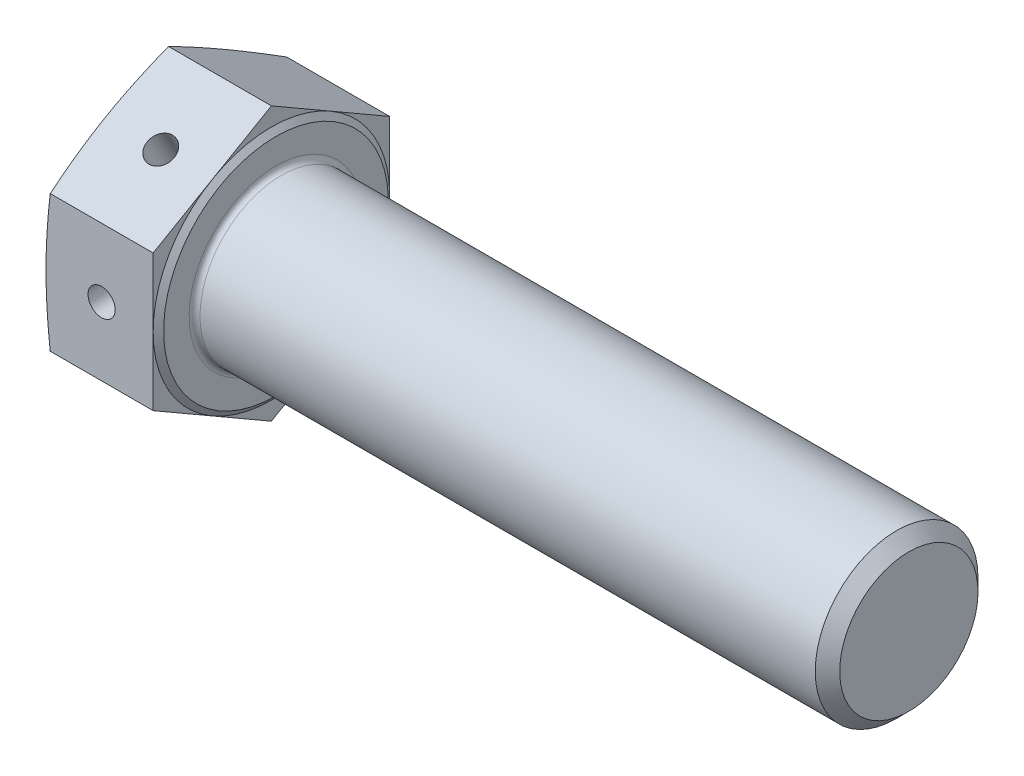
ISO-10303-21;
HEADER;
FILE_DESCRIPTION(('STEP AP214'),'2;1');
FILE_NAME('part.step','',(''),(''),'','','');
FILE_SCHEMA(('AUTOMOTIVE_DESIGN { 1 0 10303 214 1 1 1 1 }'));
ENDSEC;
DATA;
#1=APPLICATION_CONTEXT('core data for automotive mechanical design processes');
#2=APPLICATION_PROTOCOL_DEFINITION('international standard','automotive_design',2000,#1);
#3=PRODUCT_CONTEXT('',#1,'mechanical');
#4=PRODUCT('Part','Part','',(#3));
#5=PRODUCT_RELATED_PRODUCT_CATEGORY('part','',(#4));
#6=PRODUCT_DEFINITION_FORMATION('','',#4);
#7=PRODUCT_DEFINITION_CONTEXT('part definition',#1,'design');
#8=PRODUCT_DEFINITION('design','',#6,#7);
#9=PRODUCT_DEFINITION_SHAPE('','',#8);
#10=(LENGTH_UNIT() NAMED_UNIT(*) SI_UNIT(.MILLI.,.METRE.));
#11=(NAMED_UNIT(*) PLANE_ANGLE_UNIT() SI_UNIT($,.RADIAN.));
#12=(NAMED_UNIT(*) SI_UNIT($,.STERADIAN.) SOLID_ANGLE_UNIT());
#13=UNCERTAINTY_MEASURE_WITH_UNIT(LENGTH_MEASURE(1.E-05),#10,'distance_accuracy_value','');
#14=(GEOMETRIC_REPRESENTATION_CONTEXT(3) GLOBAL_UNCERTAINTY_ASSIGNED_CONTEXT((#13)) GLOBAL_UNIT_ASSIGNED_CONTEXT((#10,
#11,#12)) REPRESENTATION_CONTEXT('',''));
#15=CARTESIAN_POINT('',(0.,0.,0.));
#16=DIRECTION('',(0.,0.,1.));
#17=DIRECTION('',(1.,0.,0.));
#18=AXIS2_PLACEMENT_3D('',#15,#16,#17);
#19=CARTESIAN_POINT('',(6.15,0.,-13.08));
#20=DIRECTION('',(0.,0.,1.));
#21=DIRECTION('',(1.,0.,0.));
#22=AXIS2_PLACEMENT_3D('',#19,#20,#21);
#23=CYLINDRICAL_SURFACE('',#22,1.5);
#24=CARTESIAN_POINT('',(6.15,0.,13.08));
#25=DIRECTION('',(0.,0.,1.));
#26=DIRECTION('',(1.,0.,0.));
#27=AXIS2_PLACEMENT_3D('',#24,#25,#26);
#28=CIRCLE('',#27,1.5);
#29=CARTESIAN_POINT('',(7.65,0.,13.08));
#30=VERTEX_POINT('',#29);
#31=EDGE_CURVE('E584',#30,#30,#28,.T.);
#32=ORIENTED_EDGE('',*,*,#31,.T.);
#33=EDGE_LOOP('',(#32));
#34=FACE_BOUND('',#33,.T.);
#35=CARTESIAN_POINT('',(6.15,0.,0.));
#36=DIRECTION('',(0.,-0.866025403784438,0.500000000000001));
#37=DIRECTION('',(0.,0.500000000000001,0.866025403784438));
#38=AXIS2_PLACEMENT_3D('',#35,#36,#37);
#39=ELLIPSE('',#38,2.99999999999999,1.5);
#40=CARTESIAN_POINT('',(4.65,0.,0.));
#41=VERTEX_POINT('',#40);
#42=CARTESIAN_POINT('',(7.65,0.,0.));
#43=VERTEX_POINT('',#42);
#44=EDGE_CURVE('E46',#41,#43,#39,.F.);
#45=ORIENTED_EDGE('',*,*,#44,.T.);
#46=CARTESIAN_POINT('',(6.15,0.,0.));
#47=DIRECTION('',(0.,0.500000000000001,0.866025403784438));
#48=DIRECTION('',(0.,-0.866025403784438,0.500000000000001));
#49=AXIS2_PLACEMENT_3D('',#46,#47,#48);
#50=ELLIPSE('',#49,1.73205080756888,1.5);
#51=EDGE_CURVE('E11',#43,#41,#50,.F.);
#52=ORIENTED_EDGE('',*,*,#51,.T.);
#53=EDGE_LOOP('',(#45,#52));
#54=FACE_BOUND('',#53,.T.);
#55=ADVANCED_FACE('F32',(#34,#54),#23,.F.);
#56=CARTESIAN_POINT('',(12.35,0.,0.));
#57=DIRECTION('',(-1.,0.,0.));
#58=DIRECTION('',(0.,-1.,0.));
#59=AXIS2_PLACEMENT_3D('',#56,#57,#58);
#60=PLANE('',#59);
#61=CARTESIAN_POINT('',(12.35,0.,0.));
#62=DIRECTION('',(-1.,0.,0.));
#63=DIRECTION('',(0.,-1.,0.));
#64=AXIS2_PLACEMENT_3D('',#61,#62,#63);
#65=CIRCLE('',#64,9.6);
#66=CARTESIAN_POINT('',(12.35,-9.6,0.));
#67=VERTEX_POINT('',#66);
#68=EDGE_CURVE('E137',#67,#67,#65,.T.);
#69=ORIENTED_EDGE('',*,*,#68,.T.);
#70=EDGE_LOOP('',(#69));
#71=FACE_BOUND('',#70,.T.);
#72=CARTESIAN_POINT('',(12.35,0.,0.));
#73=DIRECTION('',(-1.,0.,0.));
#74=DIRECTION('',(0.,-1.,0.));
#75=AXIS2_PLACEMENT_3D('',#72,#73,#74);
#76=CIRCLE('',#75,12.425);
#77=CARTESIAN_POINT('',(12.35,-12.425,0.));
#78=VERTEX_POINT('',#77);
#79=EDGE_CURVE('E284',#78,#78,#76,.T.);
#80=ORIENTED_EDGE('',*,*,#79,.F.);
#81=EDGE_LOOP('',(#80));
#82=FACE_BOUND('',#81,.T.);
#83=ADVANCED_FACE('F239',(#71,#82),#60,.F.);
#84=CARTESIAN_POINT('',(11.85,-22.6552245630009,-13.08));
#85=DIRECTION('',(1.,0.,0.));
#86=DIRECTION('',(0.,0.,-1.));
#87=AXIS2_PLACEMENT_3D('',#84,#85,#86);
#88=PLANE('',#87);
#89=DIRECTION('',(0.,-0.5,-0.866025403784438));
#90=VECTOR('',#89,1.);
#91=CARTESIAN_POINT('',(11.85,-7.55174152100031,13.08));
#92=LINE('',#91,#90);
#93=CARTESIAN_POINT('',(11.85,-7.55174152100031,13.08));
#94=VERTEX_POINT('',#93);
#95=CARTESIAN_POINT('',(11.85,-11.3276122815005,6.54));
#96=VERTEX_POINT('',#95);
#97=EDGE_CURVE('E197',#94,#96,#92,.T.);
#98=ORIENTED_EDGE('',*,*,#97,.T.);
#99=CARTESIAN_POINT('',(11.85,0.,0.));
#100=DIRECTION('',(-1.,0.,0.));
#101=DIRECTION('',(0.,-1.,0.));
#102=AXIS2_PLACEMENT_3D('',#99,#100,#101);
#103=CIRCLE('',#102,13.08);
#104=CARTESIAN_POINT('',(11.85,0.,13.08));
#105=VERTEX_POINT('',#104);
#106=EDGE_CURVE('E54',#96,#105,#103,.T.);
#107=ORIENTED_EDGE('',*,*,#106,.T.);
#108=DIRECTION('',(0.,-1.,0.));
#109=VECTOR('',#108,1.);
#110=CARTESIAN_POINT('',(11.85,7.55174152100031,13.08));
#111=LINE('',#110,#109);
#112=EDGE_CURVE('E180',#105,#94,#111,.T.);
#113=ORIENTED_EDGE('',*,*,#112,.T.);
#114=EDGE_LOOP('',(#98,#107,#113));
#115=FACE_BOUND('',#114,.T.);
#116=ADVANCED_FACE('F245',(#115),#88,.T.);
#117=CARTESIAN_POINT('',(11.85,7.55174152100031,13.08));
#118=VERTEX_POINT('',#117);
#119=EDGE_CURVE('E177',#118,#105,#111,.T.);
#120=ORIENTED_EDGE('',*,*,#119,.T.);
#121=CARTESIAN_POINT('',(11.85,11.3276122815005,6.54));
#122=VERTEX_POINT('',#121);
#123=EDGE_CURVE('E153',#105,#122,#103,.T.);
#124=ORIENTED_EDGE('',*,*,#123,.T.);
#125=DIRECTION('',(0.,-0.5,0.866025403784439));
#126=VECTOR('',#125,1.);
#127=CARTESIAN_POINT('',(11.85,15.1034830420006,0.));
#128=LINE('',#127,#126);
#129=EDGE_CURVE('E184',#122,#118,#128,.T.);
#130=ORIENTED_EDGE('',*,*,#129,.T.);
#131=EDGE_LOOP('',(#120,#124,#130));
#132=FACE_BOUND('',#131,.T.);
#133=ADVANCED_FACE('F341',(#132),#88,.T.);
#134=CARTESIAN_POINT('',(11.85,15.1034830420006,0.));
#135=VERTEX_POINT('',#134);
#136=EDGE_CURVE('E181',#135,#122,#128,.T.);
#137=ORIENTED_EDGE('',*,*,#136,.T.);
#138=CARTESIAN_POINT('',(11.85,11.3276122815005,-6.54));
#139=VERTEX_POINT('',#138);
#140=EDGE_CURVE('E346',#122,#139,#103,.T.);
#141=ORIENTED_EDGE('',*,*,#140,.T.);
#142=DIRECTION('',(0.,0.5,0.866025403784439));
#143=VECTOR('',#142,1.);
#144=CARTESIAN_POINT('',(11.85,7.55174152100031,-13.08));
#145=LINE('',#144,#143);
#146=EDGE_CURVE('E188',#139,#135,#145,.T.);
#147=ORIENTED_EDGE('',*,*,#146,.T.);
#148=EDGE_LOOP('',(#137,#141,#147));
#149=FACE_BOUND('',#148,.T.);
#150=ADVANCED_FACE('F345',(#149),#88,.T.);
#151=CARTESIAN_POINT('',(11.85,7.55174152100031,-13.08));
#152=VERTEX_POINT('',#151);
#153=EDGE_CURVE('E185',#152,#139,#145,.T.);
#154=ORIENTED_EDGE('',*,*,#153,.T.);
#155=CARTESIAN_POINT('',(11.85,0.,-13.08));
#156=VERTEX_POINT('',#155);
#157=EDGE_CURVE('E405',#139,#156,#103,.T.);
#158=ORIENTED_EDGE('',*,*,#157,.T.);
#159=DIRECTION('',(0.,1.,0.));
#160=VECTOR('',#159,1.);
#161=CARTESIAN_POINT('',(11.85,-7.55174152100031,-13.08));
#162=LINE('',#161,#160);
#163=EDGE_CURVE('E192',#156,#152,#162,.T.);
#164=ORIENTED_EDGE('',*,*,#163,.T.);
#165=EDGE_LOOP('',(#154,#158,#164));
#166=FACE_BOUND('',#165,.T.);
#167=ADVANCED_FACE('F398',(#166),#88,.T.);
#168=CARTESIAN_POINT('',(11.85,-7.55174152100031,-13.08));
#169=VERTEX_POINT('',#168);
#170=EDGE_CURVE('E189',#169,#156,#162,.T.);
#171=ORIENTED_EDGE('',*,*,#170,.T.);
#172=CARTESIAN_POINT('',(11.85,-11.3276122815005,-6.53999999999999));
#173=VERTEX_POINT('',#172);
#174=EDGE_CURVE('E403',#156,#173,#103,.T.);
#175=ORIENTED_EDGE('',*,*,#174,.T.);
#176=DIRECTION('',(0.,0.5,-0.866025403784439));
#177=VECTOR('',#176,1.);
#178=CARTESIAN_POINT('',(11.85,-15.1034830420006,0.));
#179=LINE('',#178,#177);
#180=EDGE_CURVE('E196',#173,#169,#179,.T.);
#181=ORIENTED_EDGE('',*,*,#180,.T.);
#182=EDGE_LOOP('',(#171,#175,#181));
#183=FACE_BOUND('',#182,.T.);
#184=ADVANCED_FACE('F393',(#183),#88,.T.);
#185=CARTESIAN_POINT('',(11.85,-15.1034830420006,0.));
#186=VERTEX_POINT('',#185);
#187=EDGE_CURVE('E193',#186,#173,#179,.T.);
#188=ORIENTED_EDGE('',*,*,#187,.T.);
#189=EDGE_CURVE('E292',#173,#96,#103,.T.);
#190=ORIENTED_EDGE('',*,*,#189,.T.);
#191=EDGE_CURVE('E200',#96,#186,#92,.T.);
#192=ORIENTED_EDGE('',*,*,#191,.T.);
#193=EDGE_LOOP('',(#188,#190,#192));
#194=FACE_BOUND('',#193,.T.);
#195=ADVANCED_FACE('F234',(#194),#88,.T.);
#196=CARTESIAN_POINT('',(11.85,-7.55174152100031,13.08));
#197=DIRECTION('',(0.,0.866025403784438,-0.5));
#198=DIRECTION('',(0.,0.5,0.866025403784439));
#199=AXIS2_PLACEMENT_3D('',#196,#197,#198);
#200=PLANE('',#199);
#201=CARTESIAN_POINT('',(0.470161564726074,-15.1035985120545,-0.000199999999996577));
#202=CARTESIAN_POINT('',(0.397206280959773,-14.7897253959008,0.543444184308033));
#203=CARTESIAN_POINT('',(0.331014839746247,-14.4754225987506,1.08783259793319));
#204=CARTESIAN_POINT('',(0.214770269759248,-13.8459819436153,2.178055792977));
#205=CARTESIAN_POINT('',(0.164722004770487,-13.5308438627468,2.72389096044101));
#206=CARTESIAN_POINT('',(0.0835795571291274,-12.9011725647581,3.81451364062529));
#207=CARTESIAN_POINT('',(0.0524124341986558,-12.5866417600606,4.35929697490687));
#208=CARTESIAN_POINT('',(0.0106241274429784,-11.9572780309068,5.44938693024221));
#209=CARTESIAN_POINT('',(0.,-11.6424451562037,5.99469346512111));
#210=CARTESIAN_POINT('',(0.,-11.0127794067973,7.0853065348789));
#211=CARTESIAN_POINT('',(0.0106241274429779,-10.6979465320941,7.63061306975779));
#212=CARTESIAN_POINT('',(0.0524124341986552,-10.0685828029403,8.72070302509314));
#213=CARTESIAN_POINT('',(0.0835795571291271,-9.75405199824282,9.26548635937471));
#214=CARTESIAN_POINT('',(0.164722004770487,-9.12438070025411,10.356109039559));
#215=CARTESIAN_POINT('',(0.214770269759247,-8.8092426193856,10.901944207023));
#216=CARTESIAN_POINT('',(0.331014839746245,-8.17980196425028,11.9921674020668));
#217=CARTESIAN_POINT('',(0.397206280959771,-7.86549916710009,12.536555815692));
#218=CARTESIAN_POINT('',(0.470161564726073,-7.55162605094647,13.0802));
#219=B_SPLINE_CURVE_WITH_KNOTS('',3,(#201,#202,#203,#204,#205,#206,#207,#208,#209,#210,#211,
#212,#213,#214,#215,#216,#217,#218),.UNSPECIFIED.,.F.,.F.,(4,2,2,2,2,2,2,2,4),(0.,
1.89598725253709,3.79254521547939,5.68172901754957,7.57064209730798,9.45955517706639,
11.3487389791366,13.2452969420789,15.141284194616),.UNSPECIFIED.);
#220=CARTESIAN_POINT('',(0.470134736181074,-15.1034830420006,0.));
#221=VERTEX_POINT('',#220);
#222=CARTESIAN_POINT('',(0.,-11.3276122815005,6.53999999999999));
#223=VERTEX_POINT('',#222);
#224=EDGE_CURVE('E356',#221,#223,#219,.T.);
#225=ORIENTED_EDGE('',*,*,#224,.F.);
#226=DIRECTION('',(-1.,0.,0.));
#227=VECTOR('',#226,1.);
#228=CARTESIAN_POINT('',(11.85,-15.1034830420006,0.));
#229=LINE('',#228,#227);
#230=EDGE_CURVE('E158',#186,#221,#229,.T.);
#231=ORIENTED_EDGE('',*,*,#230,.F.);
#232=ORIENTED_EDGE('',*,*,#191,.F.);
#233=ORIENTED_EDGE('',*,*,#97,.F.);
#234=DIRECTION('',(-1.,0.,0.));
#235=VECTOR('',#234,1.);
#236=CARTESIAN_POINT('',(11.85,-7.55174152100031,13.08));
#237=LINE('',#236,#235);
#238=CARTESIAN_POINT('',(0.470134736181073,-7.5517415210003,13.08));
#239=VERTEX_POINT('',#238);
#240=EDGE_CURVE('E174',#94,#239,#237,.T.);
#241=ORIENTED_EDGE('',*,*,#240,.T.);
#242=EDGE_CURVE('E333',#223,#239,#219,.T.);
#243=ORIENTED_EDGE('',*,*,#242,.F.);
#244=EDGE_LOOP('',(#225,#231,#232,#233,#241,#243));
#245=FACE_BOUND('',#244,.T.);
#246=ADVANCED_FACE('F34',(#245),#200,.F.);
#247=CARTESIAN_POINT('',(11.85,-15.1034830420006,0.));
#248=DIRECTION('',(0.,0.866025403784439,0.5));
#249=DIRECTION('',(0.,-0.5,0.866025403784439));
#250=AXIS2_PLACEMENT_3D('',#247,#248,#249);
#251=PLANE('',#250);
#252=CARTESIAN_POINT('',(6.15,-11.3276122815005,-6.53999999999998));
#253=DIRECTION('',(0.,0.866025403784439,0.5));
#254=DIRECTION('',(0.,-0.5,0.866025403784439));
#255=AXIS2_PLACEMENT_3D('',#252,#253,#254);
#256=CIRCLE('',#255,1.5);
#257=CARTESIAN_POINT('',(6.15,-12.0776122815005,-5.24096189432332));
#258=VERTEX_POINT('',#257);
#259=EDGE_CURVE('E582',#258,#258,#256,.T.);
#260=ORIENTED_EDGE('',*,*,#259,.T.);
#261=EDGE_LOOP('',(#260));
#262=FACE_BOUND('',#261,.T.);
#263=CARTESIAN_POINT('',(0.470161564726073,-7.55162605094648,-13.0802));
#264=CARTESIAN_POINT('',(0.397206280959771,-7.86549916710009,-12.536555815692));
#265=CARTESIAN_POINT('',(0.331014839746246,-8.17980196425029,-11.9921674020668));
#266=CARTESIAN_POINT('',(0.214770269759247,-8.80924261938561,-10.901944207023));
#267=CARTESIAN_POINT('',(0.164722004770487,-9.12438070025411,-10.356109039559));
#268=CARTESIAN_POINT('',(0.0835795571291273,-9.75405199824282,-9.26548635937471));
#269=CARTESIAN_POINT('',(0.0524124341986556,-10.0685828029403,-8.72070302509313));
#270=CARTESIAN_POINT('',(0.0106241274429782,-10.6979465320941,-7.63061306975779));
#271=CARTESIAN_POINT('',(0.,-11.0127794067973,-7.08530653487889));
#272=CARTESIAN_POINT('',(0.,-11.6424451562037,-5.9946934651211));
#273=CARTESIAN_POINT('',(0.0106241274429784,-11.9572780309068,-5.44938693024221));
#274=CARTESIAN_POINT('',(0.0524124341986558,-12.5866417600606,-4.35929697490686));
#275=CARTESIAN_POINT('',(0.0835795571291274,-12.9011725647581,-3.81451364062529));
#276=CARTESIAN_POINT('',(0.164722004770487,-13.5308438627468,-2.723890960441));
#277=CARTESIAN_POINT('',(0.214770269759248,-13.8459819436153,-2.178055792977));
#278=CARTESIAN_POINT('',(0.331014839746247,-14.4754225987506,-1.08783259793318));
#279=CARTESIAN_POINT('',(0.397206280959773,-14.7897253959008,-0.543444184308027));
#280=CARTESIAN_POINT('',(0.470161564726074,-15.1035985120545,0.000200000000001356));
#281=B_SPLINE_CURVE_WITH_KNOTS('',3,(#263,#264,#265,#266,#267,#268,#269,#270,#271,#272,#273,
#274,#275,#276,#277,#278,#279,#280),.UNSPECIFIED.,.F.,.F.,(4,2,2,2,2,2,2,2,4),(0.,
1.89598725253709,3.79254521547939,5.68172901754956,7.57064209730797,9.45955517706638,
11.3487389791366,13.2452969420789,15.1412841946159),.UNSPECIFIED.);
#282=CARTESIAN_POINT('',(0.470134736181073,-7.5517415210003,-13.08));
#283=VERTEX_POINT('',#282);
#284=CARTESIAN_POINT('',(0.,-11.3276122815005,-6.54));
#285=VERTEX_POINT('',#284);
#286=EDGE_CURVE('E355',#283,#285,#281,.T.);
#287=ORIENTED_EDGE('',*,*,#286,.F.);
#288=DIRECTION('',(-1.,0.,0.));
#289=VECTOR('',#288,1.);
#290=CARTESIAN_POINT('',(11.85,-7.55174152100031,-13.08));
#291=LINE('',#290,#289);
#292=EDGE_CURVE('E162',#169,#283,#291,.T.);
#293=ORIENTED_EDGE('',*,*,#292,.F.);
#294=ORIENTED_EDGE('',*,*,#180,.F.);
#295=ORIENTED_EDGE('',*,*,#187,.F.);
#296=ORIENTED_EDGE('',*,*,#230,.T.);
#297=EDGE_CURVE('E210',#285,#221,#281,.T.);
#298=ORIENTED_EDGE('',*,*,#297,.F.);
#299=EDGE_LOOP('',(#287,#293,#294,#295,#296,#298));
#300=FACE_BOUND('',#299,.T.);
#301=ADVANCED_FACE('F224',(#262,#300),#251,.F.);
#302=CARTESIAN_POINT('',(11.85,-7.55174152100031,-13.08));
#303=DIRECTION('',(0.,0.,1.));
#304=DIRECTION('',(1.,0.,0.));
#305=AXIS2_PLACEMENT_3D('',#302,#303,#304);
#306=PLANE('',#305);
#307=CARTESIAN_POINT('',(6.15,0.,-13.08));
#308=DIRECTION('',(0.,0.,1.));
#309=DIRECTION('',(1.,0.,0.));
#310=AXIS2_PLACEMENT_3D('',#307,#308,#309);
#311=CIRCLE('',#310,1.5);
#312=CARTESIAN_POINT('',(7.65,0.,-13.08));
#313=VERTEX_POINT('',#312);
#314=EDGE_CURVE('E290',#313,#313,#311,.T.);
#315=ORIENTED_EDGE('',*,*,#314,.T.);
#316=EDGE_LOOP('',(#315));
#317=FACE_BOUND('',#316,.T.);
#318=CARTESIAN_POINT('',(2.50461707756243,-19.9552742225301,-13.08));
#319=CARTESIAN_POINT('',(2.38933293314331,-19.3618371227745,-13.08));
#320=CARTESIAN_POINT('',(2.27548069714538,-18.7681168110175,-13.08));
#321=CARTESIAN_POINT('',(2.05140636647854,-17.5799721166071,-13.08));
#322=CARTESIAN_POINT('',(1.94118439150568,-16.9855477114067,-13.08));
#323=CARTESIAN_POINT('',(1.7250646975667,-15.7954562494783,-13.08));
#324=CARTESIAN_POINT('',(1.61917023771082,-15.199788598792,-13.08));
#325=CARTESIAN_POINT('',(1.41282248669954,-14.007512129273,-13.08));
#326=CARTESIAN_POINT('',(1.31236916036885,-13.4109033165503,-13.08));
#327=CARTESIAN_POINT('',(1.11875923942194,-12.2201234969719,-13.08));
#328=CARTESIAN_POINT('',(1.02556295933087,-11.6259589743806,-13.08));
#329=CARTESIAN_POINT('',(0.847378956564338,-10.4363906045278,-13.08));
#330=CARTESIAN_POINT('',(0.762391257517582,-9.8409867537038,-13.08));
#331=CARTESIAN_POINT('',(0.602527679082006,-8.64887566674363,-13.08));
#332=CARTESIAN_POINT('',(0.527650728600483,-8.05216857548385,-13.08));
#333=CARTESIAN_POINT('',(0.390191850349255,-6.85732419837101,-13.08));
#334=CARTESIAN_POINT('',(0.327609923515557,-6.25918691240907,-13.08));
#335=CARTESIAN_POINT('',(0.216637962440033,-5.05651876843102,-13.08));
#336=CARTESIAN_POINT('',(0.168371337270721,-4.45197635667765,-13.08));
#337=CARTESIAN_POINT('',(0.0890404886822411,-3.24175411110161,-13.08));
#338=CARTESIAN_POINT('',(0.0579759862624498,-2.63607429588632,-13.08));
#339=CARTESIAN_POINT('',(0.0147985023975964,-1.42422632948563,-13.08));
#340=CARTESIAN_POINT('',(0.0026792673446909,-0.818058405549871,-13.08));
#341=CARTESIAN_POINT('',(-0.00188208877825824,0.394352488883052,-13.08));
#342=CARTESIAN_POINT('',(0.005675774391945,1.00059545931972,-13.08));
#343=CARTESIAN_POINT('',(0.0400462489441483,2.21417893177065,-13.08));
#344=CARTESIAN_POINT('',(0.0669113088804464,2.82151791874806,-13.08));
#345=CARTESIAN_POINT('',(0.13839689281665,4.03514034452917,-13.08));
#346=CARTESIAN_POINT('',(0.183017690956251,4.6414237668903,-13.08));
#347=CARTESIAN_POINT('',(0.287809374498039,5.85291228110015,-13.08));
#348=CARTESIAN_POINT('',(0.347987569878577,6.45811673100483,-13.08));
#349=CARTESIAN_POINT('',(0.48143830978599,7.66706460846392,-13.08));
#350=CARTESIAN_POINT('',(0.554710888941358,8.27080803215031,-13.08));
#351=CARTESIAN_POINT('',(0.707155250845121,9.43950253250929,-13.08));
#352=CARTESIAN_POINT('',(0.785680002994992,10.004538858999,-13.08));
#353=CARTESIAN_POINT('',(0.950532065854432,11.1334777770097,-13.08));
#354=CARTESIAN_POINT('',(1.03685954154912,11.6973803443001,-13.08));
#355=CARTESIAN_POINT('',(1.21590689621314,12.8242101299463,-13.08));
#356=CARTESIAN_POINT('',(1.30862727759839,13.3871372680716,-13.08));
#357=CARTESIAN_POINT('',(1.49929381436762,14.5120985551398,-13.08));
#358=CARTESIAN_POINT('',(1.59723993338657,15.0741327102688,-13.08));
#359=CARTESIAN_POINT('',(1.79744056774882,16.1975541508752,-13.08));
#360=CARTESIAN_POINT('',(1.89969599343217,16.7589412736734,-13.08));
#361=CARTESIAN_POINT('',(2.10774881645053,17.8810597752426,-13.08));
#362=CARTESIAN_POINT('',(2.21354622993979,18.4417911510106,-13.08));
#363=CARTESIAN_POINT('',(2.53530217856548,20.1230887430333,-13.08));
#364=CARTESIAN_POINT('',(2.75563508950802,21.2428174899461,-13.08));
#365=CARTESIAN_POINT('',(3.20278797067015,23.472373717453,-13.08));
#366=CARTESIAN_POINT('',(3.42954806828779,24.5822132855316,-13.08));
#367=CARTESIAN_POINT('',(3.88888753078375,26.8007017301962,-13.08));
#368=CARTESIAN_POINT('',(4.12146697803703,27.9093505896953,-13.08));
#369=CARTESIAN_POINT('',(4.59069890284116,30.1246330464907,-13.08));
#370=CARTESIAN_POINT('',(4.82734710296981,31.2312675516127,-13.08));
#371=CARTESIAN_POINT('',(5.18476502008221,32.890676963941,-13.08));
#372=CARTESIAN_POINT('',(5.3043104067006,33.4437160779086,-13.08));
#373=CARTESIAN_POINT('',(5.54412289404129,34.5496373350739,-13.08));
#374=CARTESIAN_POINT('',(5.66438999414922,35.1025194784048,-13.08));
#375=CARTESIAN_POINT('',(5.7849708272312,35.6553331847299,-13.08));
#376=B_SPLINE_CURVE_WITH_KNOTS('',3,(#318,#319,#320,#321,#322,#323,#324,#325,#326,#327,#328,
#329,#330,#331,#332,#333,#334,#335,#336,#337,#338,#339,#340,#341,#342,#343,#344,#345,#346,#347,
#348,#349,#350,#351,#352,#353,#354,#355,#356,#357,#358,#359,#360,#361,#362,#363,#364,#365,#366,
#367,#368,#369,#370,#371,#372,#373,#374,#375),.UNSPECIFIED.,.F.,.F.,(4,2,2,2,2,2,2,2,2,2,2,2,2,
2,2,2,2,2,2,2,2,2,2,2,2,2,2,2,4),(0.,1.81359938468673,3.62725850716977,5.44225925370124,
7.25724826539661,9.06148976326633,10.8657364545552,12.6697918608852,14.473847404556,
16.2930311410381,18.112185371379,19.9307389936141,21.7492911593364,23.5728022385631,
25.3963414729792,27.2207390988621,29.045141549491,30.7564772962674,32.4678492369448,
34.1793558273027,35.890850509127,37.6027085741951,39.3145744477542,42.738126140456,
46.136412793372,49.5347475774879,52.9297051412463,54.6271411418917,56.3245756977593),.UNSPECIFIED.);
#377=CARTESIAN_POINT('',(0.470134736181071,7.55174152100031,-13.08));
#378=VERTEX_POINT('',#377);
#379=CARTESIAN_POINT('',(0.,0.,-13.08));
#380=VERTEX_POINT('',#379);
#381=EDGE_CURVE('E208',#378,#380,#376,.F.);
#382=ORIENTED_EDGE('',*,*,#381,.F.);
#383=DIRECTION('',(-1.,0.,0.));
#384=VECTOR('',#383,1.);
#385=CARTESIAN_POINT('',(11.85,7.55174152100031,-13.08));
#386=LINE('',#385,#384);
#387=EDGE_CURVE('E165',#152,#378,#386,.T.);
#388=ORIENTED_EDGE('',*,*,#387,.F.);
#389=ORIENTED_EDGE('',*,*,#163,.F.);
#390=ORIENTED_EDGE('',*,*,#170,.F.);
#391=ORIENTED_EDGE('',*,*,#292,.T.);
#392=EDGE_CURVE('E201',#380,#283,#376,.F.);
#393=ORIENTED_EDGE('',*,*,#392,.F.);
#394=EDGE_LOOP('',(#382,#388,#389,#390,#391,#393));
#395=FACE_BOUND('',#394,.T.);
#396=ADVANCED_FACE('F219',(#317,#395),#306,.F.);
#397=CARTESIAN_POINT('',(11.85,7.55174152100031,-13.08));
#398=DIRECTION('',(0.,-0.866025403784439,0.5));
#399=DIRECTION('',(0.,-0.5,-0.866025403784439));
#400=AXIS2_PLACEMENT_3D('',#397,#398,#399);
#401=PLANE('',#400);
#402=CARTESIAN_POINT('',(0.470161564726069,15.1035985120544,0.000199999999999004));
#403=CARTESIAN_POINT('',(0.397206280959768,14.7897253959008,-0.543444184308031));
#404=CARTESIAN_POINT('',(0.331014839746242,14.4754225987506,-1.08783259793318));
#405=CARTESIAN_POINT('',(0.214770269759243,13.8459819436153,-2.178055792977));
#406=CARTESIAN_POINT('',(0.164722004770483,13.5308438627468,-2.723890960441));
#407=CARTESIAN_POINT('',(0.0835795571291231,12.9011725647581,-3.81451364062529));
#408=CARTESIAN_POINT('',(0.0524124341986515,12.5866417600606,-4.35929697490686));
#409=CARTESIAN_POINT('',(0.0106241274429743,11.9572780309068,-5.44938693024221));
#410=CARTESIAN_POINT('',(0.,11.6424451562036,-5.99469346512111));
#411=CARTESIAN_POINT('',(0.,11.0127794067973,-7.08530653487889));
#412=CARTESIAN_POINT('',(0.0106241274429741,10.6979465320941,-7.63061306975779));
#413=CARTESIAN_POINT('',(0.0524124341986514,10.0685828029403,-8.72070302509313));
#414=CARTESIAN_POINT('',(0.0835795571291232,9.75405199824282,-9.26548635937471));
#415=CARTESIAN_POINT('',(0.164722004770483,9.12438070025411,-10.356109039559));
#416=CARTESIAN_POINT('',(0.214770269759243,8.8092426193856,-10.901944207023));
#417=CARTESIAN_POINT('',(0.331014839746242,8.17980196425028,-11.9921674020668));
#418=CARTESIAN_POINT('',(0.397206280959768,7.86549916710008,-12.536555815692));
#419=CARTESIAN_POINT('',(0.47016156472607,7.55162605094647,-13.0802));
#420=B_SPLINE_CURVE_WITH_KNOTS('',3,(#402,#403,#404,#405,#406,#407,#408,#409,#410,#411,#412,
#413,#414,#415,#416,#417,#418,#419),.UNSPECIFIED.,.F.,.F.,(4,2,2,2,2,2,2,2,4),(0.,
1.89598725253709,3.79254521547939,5.68172901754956,7.57064209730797,9.45955517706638,
11.3487389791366,13.2452969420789,15.1412841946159),.UNSPECIFIED.);
#421=CARTESIAN_POINT('',(0.47013473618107,15.1034830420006,0.));
#422=VERTEX_POINT('',#421);
#423=CARTESIAN_POINT('',(0.,11.3276122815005,-6.54));
#424=VERTEX_POINT('',#423);
#425=EDGE_CURVE('E352',#422,#424,#420,.T.);
#426=ORIENTED_EDGE('',*,*,#425,.F.);
#427=DIRECTION('',(-1.,0.,0.));
#428=VECTOR('',#427,1.);
#429=CARTESIAN_POINT('',(11.85,15.1034830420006,0.));
#430=LINE('',#429,#428);
#431=EDGE_CURVE('E168',#135,#422,#430,.T.);
#432=ORIENTED_EDGE('',*,*,#431,.F.);
#433=ORIENTED_EDGE('',*,*,#146,.F.);
#434=ORIENTED_EDGE('',*,*,#153,.F.);
#435=ORIENTED_EDGE('',*,*,#387,.T.);
#436=EDGE_CURVE('E209',#424,#378,#420,.T.);
#437=ORIENTED_EDGE('',*,*,#436,.F.);
#438=EDGE_LOOP('',(#426,#432,#433,#434,#435,#437));
#439=FACE_BOUND('',#438,.T.);
#440=ADVANCED_FACE('F223',(#439),#401,.F.);
#441=CARTESIAN_POINT('',(11.85,15.1034830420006,0.));
#442=DIRECTION('',(0.,-0.866025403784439,-0.5));
#443=DIRECTION('',(0.,0.5,-0.866025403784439));
#444=AXIS2_PLACEMENT_3D('',#441,#442,#443);
#445=PLANE('',#444);
#446=CARTESIAN_POINT('',(6.15,11.3276122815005,6.53999999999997));
#447=DIRECTION('',(0.,-0.866025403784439,-0.5));
#448=DIRECTION('',(0.,0.5,-0.866025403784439));
#449=AXIS2_PLACEMENT_3D('',#446,#447,#448);
#450=CIRCLE('',#449,1.5);
#451=CARTESIAN_POINT('',(6.15,12.0776122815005,5.24096189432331));
#452=VERTEX_POINT('',#451);
#453=EDGE_CURVE('E323',#452,#452,#450,.T.);
#454=ORIENTED_EDGE('',*,*,#453,.T.);
#455=EDGE_LOOP('',(#454));
#456=FACE_BOUND('',#455,.T.);
#457=CARTESIAN_POINT('',(0.470161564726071,7.55162605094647,13.0802));
#458=CARTESIAN_POINT('',(0.397206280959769,7.86549916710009,12.536555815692));
#459=CARTESIAN_POINT('',(0.331014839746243,8.17980196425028,11.9921674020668));
#460=CARTESIAN_POINT('',(0.214770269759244,8.8092426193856,10.901944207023));
#461=CARTESIAN_POINT('',(0.164722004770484,9.12438070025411,10.356109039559));
#462=CARTESIAN_POINT('',(0.0835795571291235,9.75405199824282,9.26548635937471));
#463=CARTESIAN_POINT('',(0.0524124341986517,10.0685828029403,8.72070302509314));
#464=CARTESIAN_POINT('',(0.0106241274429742,10.6979465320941,7.63061306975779));
#465=CARTESIAN_POINT('',(0.,11.0127794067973,7.0853065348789));
#466=CARTESIAN_POINT('',(0.,11.6424451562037,5.99469346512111));
#467=CARTESIAN_POINT('',(0.0106241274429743,11.9572780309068,5.44938693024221));
#468=CARTESIAN_POINT('',(0.0524124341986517,12.5866417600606,4.35929697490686));
#469=CARTESIAN_POINT('',(0.0835795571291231,12.9011725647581,3.81451364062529));
#470=CARTESIAN_POINT('',(0.164722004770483,13.5308438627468,2.723890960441));
#471=CARTESIAN_POINT('',(0.214770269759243,13.8459819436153,2.178055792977));
#472=CARTESIAN_POINT('',(0.331014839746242,14.4754225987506,1.08783259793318));
#473=CARTESIAN_POINT('',(0.397206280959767,14.7897253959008,0.543444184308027));
#474=CARTESIAN_POINT('',(0.470161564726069,15.1035985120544,-0.000199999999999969));
#475=B_SPLINE_CURVE_WITH_KNOTS('',3,(#457,#458,#459,#460,#461,#462,#463,#464,#465,#466,#467,
#468,#469,#470,#471,#472,#473,#474),.UNSPECIFIED.,.F.,.F.,(4,2,2,2,2,2,2,2,4),(0.,
1.89598725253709,3.79254521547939,5.68172901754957,7.57064209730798,9.45955517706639,
11.3487389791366,13.2452969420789,15.141284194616),.UNSPECIFIED.);
#476=CARTESIAN_POINT('',(0.470134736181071,7.5517415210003,13.08));
#477=VERTEX_POINT('',#476);
#478=CARTESIAN_POINT('',(0.,11.3276122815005,6.53999999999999));
#479=VERTEX_POINT('',#478);
#480=EDGE_CURVE('E301',#477,#479,#475,.T.);
#481=ORIENTED_EDGE('',*,*,#480,.F.);
#482=DIRECTION('',(-1.,0.,0.));
#483=VECTOR('',#482,1.);
#484=CARTESIAN_POINT('',(11.85,7.55174152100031,13.08));
#485=LINE('',#484,#483);
#486=EDGE_CURVE('E171',#118,#477,#485,.T.);
#487=ORIENTED_EDGE('',*,*,#486,.F.);
#488=ORIENTED_EDGE('',*,*,#129,.F.);
#489=ORIENTED_EDGE('',*,*,#136,.F.);
#490=ORIENTED_EDGE('',*,*,#431,.T.);
#491=EDGE_CURVE('E329',#479,#422,#475,.T.);
#492=ORIENTED_EDGE('',*,*,#491,.F.);
#493=EDGE_LOOP('',(#481,#487,#488,#489,#490,#492));
#494=FACE_BOUND('',#493,.T.);
#495=ADVANCED_FACE('F311',(#456,#494),#445,.F.);
#496=CARTESIAN_POINT('',(11.85,7.55174152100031,13.08));
#497=DIRECTION('',(0.,0.,-1.));
#498=DIRECTION('',(-1.,0.,0.));
#499=AXIS2_PLACEMENT_3D('',#496,#497,#498);
#500=PLANE('',#499);
#501=ORIENTED_EDGE('',*,*,#31,.F.);
#502=EDGE_LOOP('',(#501));
#503=FACE_BOUND('',#502,.T.);
#504=CARTESIAN_POINT('',(2.50461707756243,-19.9552742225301,13.08));
#505=CARTESIAN_POINT('',(2.38933293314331,-19.3618371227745,13.08));
#506=CARTESIAN_POINT('',(2.27548069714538,-18.7681168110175,13.08));
#507=CARTESIAN_POINT('',(2.05140636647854,-17.5799721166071,13.08));
#508=CARTESIAN_POINT('',(1.94118439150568,-16.9855477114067,13.08));
#509=CARTESIAN_POINT('',(1.7250646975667,-15.7954562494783,13.08));
#510=CARTESIAN_POINT('',(1.61917023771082,-15.199788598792,13.08));
#511=CARTESIAN_POINT('',(1.41282248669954,-14.007512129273,13.08));
#512=CARTESIAN_POINT('',(1.31236916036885,-13.4109033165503,13.08));
#513=CARTESIAN_POINT('',(1.11875923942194,-12.2201234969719,13.08));
#514=CARTESIAN_POINT('',(1.02556295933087,-11.6259589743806,13.08));
#515=CARTESIAN_POINT('',(0.847378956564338,-10.4363906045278,13.08));
#516=CARTESIAN_POINT('',(0.762391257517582,-9.84098675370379,13.08));
#517=CARTESIAN_POINT('',(0.602527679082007,-8.64887566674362,13.08));
#518=CARTESIAN_POINT('',(0.527650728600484,-8.05216857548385,13.08));
#519=CARTESIAN_POINT('',(0.390191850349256,-6.85732419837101,13.08));
#520=CARTESIAN_POINT('',(0.327609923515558,-6.25918691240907,13.08));
#521=CARTESIAN_POINT('',(0.216637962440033,-5.05651876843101,13.08));
#522=CARTESIAN_POINT('',(0.168371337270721,-4.45197635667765,13.08));
#523=CARTESIAN_POINT('',(0.0890404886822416,-3.24175411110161,13.08));
#524=CARTESIAN_POINT('',(0.0579759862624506,-2.63607429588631,13.08));
#525=CARTESIAN_POINT('',(0.0147985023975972,-1.42422632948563,13.08));
#526=CARTESIAN_POINT('',(0.00267926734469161,-0.818058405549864,13.08));
#527=CARTESIAN_POINT('',(-0.00188208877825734,0.39435248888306,13.08));
#528=CARTESIAN_POINT('',(0.00567577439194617,1.00059545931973,13.08));
#529=CARTESIAN_POINT('',(0.0400462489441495,2.21417893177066,13.08));
#530=CARTESIAN_POINT('',(0.0669113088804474,2.82151791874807,13.08));
#531=CARTESIAN_POINT('',(0.138396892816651,4.03514034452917,13.08));
#532=CARTESIAN_POINT('',(0.183017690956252,4.64142376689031,13.08));
#533=CARTESIAN_POINT('',(0.287809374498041,5.85291228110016,13.08));
#534=CARTESIAN_POINT('',(0.347987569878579,6.45811673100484,13.08));
#535=CARTESIAN_POINT('',(0.481438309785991,7.66706460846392,13.08));
#536=CARTESIAN_POINT('',(0.554710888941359,8.27080803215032,13.08));
#537=CARTESIAN_POINT('',(0.707155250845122,9.4395025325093,13.08));
#538=CARTESIAN_POINT('',(0.785680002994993,10.004538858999,13.08));
#539=CARTESIAN_POINT('',(0.950532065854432,11.1334777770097,13.08));
#540=CARTESIAN_POINT('',(1.03685954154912,11.6973803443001,13.08));
#541=CARTESIAN_POINT('',(1.21590689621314,12.8242101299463,13.08));
#542=CARTESIAN_POINT('',(1.30862727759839,13.3871372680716,13.08));
#543=CARTESIAN_POINT('',(1.49929381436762,14.5120985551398,13.08));
#544=CARTESIAN_POINT('',(1.59723993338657,15.0741327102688,13.08));
#545=CARTESIAN_POINT('',(1.79744056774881,16.1975541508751,13.08));
#546=CARTESIAN_POINT('',(1.89969599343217,16.7589412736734,13.08));
#547=CARTESIAN_POINT('',(2.10774881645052,17.8810597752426,13.08));
#548=CARTESIAN_POINT('',(2.21354622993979,18.4417911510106,13.08));
#549=CARTESIAN_POINT('',(2.53530217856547,20.1230887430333,13.08));
#550=CARTESIAN_POINT('',(2.75563508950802,21.2428174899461,13.08));
#551=CARTESIAN_POINT('',(3.20278797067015,23.472373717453,13.08));
#552=CARTESIAN_POINT('',(3.42954806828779,24.5822132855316,13.08));
#553=CARTESIAN_POINT('',(3.88888753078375,26.8007017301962,13.08));
#554=CARTESIAN_POINT('',(4.12146697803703,27.9093505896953,13.08));
#555=CARTESIAN_POINT('',(4.59069890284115,30.1246330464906,13.08));
#556=CARTESIAN_POINT('',(4.8273471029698,31.2312675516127,13.08));
#557=CARTESIAN_POINT('',(5.1847650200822,32.890676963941,13.08));
#558=CARTESIAN_POINT('',(5.3043104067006,33.4437160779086,13.08));
#559=CARTESIAN_POINT('',(5.54412289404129,34.5496373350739,13.08));
#560=CARTESIAN_POINT('',(5.66438999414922,35.1025194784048,13.08));
#561=CARTESIAN_POINT('',(5.7849708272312,35.6553331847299,13.08));
#562=B_SPLINE_CURVE_WITH_KNOTS('',3,(#504,#505,#506,#507,#508,#509,#510,#511,#512,#513,#514,
#515,#516,#517,#518,#519,#520,#521,#522,#523,#524,#525,#526,#527,#528,#529,#530,#531,#532,#533,
#534,#535,#536,#537,#538,#539,#540,#541,#542,#543,#544,#545,#546,#547,#548,#549,#550,#551,#552,
#553,#554,#555,#556,#557,#558,#559,#560,#561),.UNSPECIFIED.,.F.,.F.,(4,2,2,2,2,2,2,2,2,2,2,2,2,
2,2,2,2,2,2,2,2,2,2,2,2,2,2,2,4),(0.,1.81359938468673,3.62725850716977,5.44225925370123,
7.2572482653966,9.06148976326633,10.8657364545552,12.6697918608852,14.473847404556,
16.2930311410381,18.112185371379,19.9307389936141,21.7492911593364,23.5728022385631,
25.3963414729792,27.2207390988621,29.045141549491,30.7564772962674,32.4678492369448,
34.1793558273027,35.890850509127,37.6027085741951,39.3145744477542,42.738126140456,
46.136412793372,49.5347475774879,52.9297051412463,54.6271411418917,56.3245756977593),.UNSPECIFIED.);
#563=CARTESIAN_POINT('',(0.,0.,13.08));
#564=VERTEX_POINT('',#563);
#565=EDGE_CURVE('E300',#239,#564,#562,.T.);
#566=ORIENTED_EDGE('',*,*,#565,.F.);
#567=ORIENTED_EDGE('',*,*,#240,.F.);
#568=ORIENTED_EDGE('',*,*,#112,.F.);
#569=ORIENTED_EDGE('',*,*,#119,.F.);
#570=ORIENTED_EDGE('',*,*,#486,.T.);
#571=EDGE_CURVE('E288',#564,#477,#562,.T.);
#572=ORIENTED_EDGE('',*,*,#571,.F.);
#573=EDGE_LOOP('',(#566,#567,#568,#569,#570,#572));
#574=FACE_BOUND('',#573,.T.);
#575=ADVANCED_FACE('F306',(#503,#574),#500,.F.);
#576=CARTESIAN_POINT('',(0.,0.,0.));
#577=DIRECTION('',(1.,0.,0.));
#578=DIRECTION('',(0.,1.,0.));
#579=AXIS2_PLACEMENT_3D('',#576,#577,#578);
#580=CONICAL_SURFACE('',#579,13.08,1.34250726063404);
#581=ORIENTED_EDGE('',*,*,#392,.T.);
#582=ORIENTED_EDGE('',*,*,#286,.T.);
#583=CARTESIAN_POINT('',(0.,0.,0.));
#584=DIRECTION('',(1.,0.,0.));
#585=DIRECTION('',(0.,0.,-1.));
#586=AXIS2_PLACEMENT_3D('',#583,#584,#585);
#587=CIRCLE('',#586,13.08);
#588=EDGE_CURVE('E154',#285,#380,#587,.T.);
#589=ORIENTED_EDGE('',*,*,#588,.T.);
#590=EDGE_LOOP('',(#581,#582,#589));
#591=FACE_BOUND('',#590,.T.);
#592=ADVANCED_FACE('F310',(#591),#580,.T.);
#593=ORIENTED_EDGE('',*,*,#297,.T.);
#594=ORIENTED_EDGE('',*,*,#224,.T.);
#595=EDGE_CURVE('E157',#223,#285,#587,.T.);
#596=ORIENTED_EDGE('',*,*,#595,.T.);
#597=EDGE_LOOP('',(#593,#594,#596));
#598=FACE_BOUND('',#597,.T.);
#599=ADVANCED_FACE('F377',(#598),#580,.T.);
#600=ORIENTED_EDGE('',*,*,#242,.T.);
#601=ORIENTED_EDGE('',*,*,#565,.T.);
#602=CARTESIAN_POINT('',(0.,0.,0.));
#603=DIRECTION('',(-1.,0.,0.));
#604=DIRECTION('',(0.,-1.,0.));
#605=AXIS2_PLACEMENT_3D('',#602,#603,#604);
#606=CIRCLE('',#605,13.08);
#607=EDGE_CURVE('E286',#223,#564,#606,.T.);
#608=ORIENTED_EDGE('',*,*,#607,.F.);
#609=EDGE_LOOP('',(#600,#601,#608));
#610=FACE_BOUND('',#609,.T.);
#611=ADVANCED_FACE('F385',(#610),#580,.T.);
#612=ORIENTED_EDGE('',*,*,#480,.T.);
#613=EDGE_CURVE('E407',#479,#564,#587,.T.);
#614=ORIENTED_EDGE('',*,*,#613,.T.);
#615=ORIENTED_EDGE('',*,*,#571,.T.);
#616=EDGE_LOOP('',(#612,#614,#615));
#617=FACE_BOUND('',#616,.T.);
#618=ADVANCED_FACE('F409',(#617),#580,.T.);
#619=ORIENTED_EDGE('',*,*,#425,.T.);
#620=EDGE_CURVE('E406',#424,#479,#587,.T.);
#621=ORIENTED_EDGE('',*,*,#620,.T.);
#622=ORIENTED_EDGE('',*,*,#491,.T.);
#623=EDGE_LOOP('',(#619,#621,#622));
#624=FACE_BOUND('',#623,.T.);
#625=ADVANCED_FACE('F411',(#624),#580,.T.);
#626=ORIENTED_EDGE('',*,*,#381,.T.);
#627=EDGE_CURVE('E159',#380,#424,#587,.T.);
#628=ORIENTED_EDGE('',*,*,#627,.T.);
#629=ORIENTED_EDGE('',*,*,#436,.T.);
#630=EDGE_LOOP('',(#626,#628,#629));
#631=FACE_BOUND('',#630,.T.);
#632=ADVANCED_FACE('F215',(#631),#580,.T.);
#633=CARTESIAN_POINT('',(0.,-22.6552245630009,-13.08));
#634=DIRECTION('',(1.,0.,0.));
#635=DIRECTION('',(0.,0.,-1.));
#636=AXIS2_PLACEMENT_3D('',#633,#634,#635);
#637=PLANE('',#636);
#638=ORIENTED_EDGE('',*,*,#627,.F.);
#639=ORIENTED_EDGE('',*,*,#588,.F.);
#640=ORIENTED_EDGE('',*,*,#595,.F.);
#641=ORIENTED_EDGE('',*,*,#607,.T.);
#642=ORIENTED_EDGE('',*,*,#613,.F.);
#643=ORIENTED_EDGE('',*,*,#620,.F.);
#644=EDGE_LOOP('',(#638,#639,#640,#641,#642,#643));
#645=FACE_BOUND('',#644,.T.);
#646=ADVANCED_FACE('F276',(#645),#637,.F.);
#647=CARTESIAN_POINT('',(12.35,0.,0.));
#648=DIRECTION('',(-1.,0.,0.));
#649=DIRECTION('',(0.,-1.,0.));
#650=AXIS2_PLACEMENT_3D('',#647,#648,#649);
#651=CONICAL_SURFACE('',#650,12.425,0.918800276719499);
#652=ORIENTED_EDGE('',*,*,#106,.F.);
#653=ORIENTED_EDGE('',*,*,#189,.F.);
#654=ORIENTED_EDGE('',*,*,#174,.F.);
#655=ORIENTED_EDGE('',*,*,#157,.F.);
#656=ORIENTED_EDGE('',*,*,#140,.F.);
#657=ORIENTED_EDGE('',*,*,#123,.F.);
#658=EDGE_LOOP('',(#652,#653,#654,#655,#656,#657));
#659=FACE_BOUND('',#658,.T.);
#660=ORIENTED_EDGE('',*,*,#79,.T.);
#661=EDGE_LOOP('',(#660));
#662=FACE_BOUND('',#661,.T.);
#663=ADVANCED_FACE('F273',(#659,#662),#651,.T.);
#664=CARTESIAN_POINT('',(82.35,0.,0.));
#665=DIRECTION('',(-1.,0.,0.));
#666=DIRECTION('',(0.,-1.,0.));
#667=AXIS2_PLACEMENT_3D('',#664,#665,#666);
#668=CYLINDRICAL_SURFACE('',#667,9.);
#669=CARTESIAN_POINT('',(12.95,0.,0.));
#670=DIRECTION('',(-1.,0.,0.));
#671=DIRECTION('',(0.,-1.,0.));
#672=AXIS2_PLACEMENT_3D('',#669,#670,#671);
#673=CIRCLE('',#672,9.);
#674=CARTESIAN_POINT('',(12.95,-9.,0.));
#675=VERTEX_POINT('',#674);
#676=EDGE_CURVE('E144',#675,#675,#673,.F.);
#677=ORIENTED_EDGE('',*,*,#676,.T.);
#678=EDGE_LOOP('',(#677));
#679=FACE_BOUND('',#678,.T.);
#680=CARTESIAN_POINT('',(80.997,0.,0.));
#681=DIRECTION('',(1.,0.,0.));
#682=DIRECTION('',(0.,1.,0.));
#683=AXIS2_PLACEMENT_3D('',#680,#681,#682);
#684=CIRCLE('',#683,9.);
#685=CARTESIAN_POINT('',(80.997,9.00000000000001,0.));
#686=VERTEX_POINT('',#685);
#687=EDGE_CURVE('E147',#686,#686,#684,.F.);
#688=ORIENTED_EDGE('',*,*,#687,.T.);
#689=EDGE_LOOP('',(#688));
#690=FACE_BOUND('',#689,.T.);
#691=ADVANCED_FACE('F269',(#679,#690),#668,.T.);
#692=CARTESIAN_POINT('',(82.35,0.,0.));
#693=DIRECTION('',(1.,0.,0.));
#694=DIRECTION('',(0.,1.,0.));
#695=AXIS2_PLACEMENT_3D('',#692,#693,#694);
#696=PLANE('',#695);
#697=CARTESIAN_POINT('',(82.35,0.,0.));
#698=DIRECTION('',(1.,0.,0.));
#699=DIRECTION('',(0.,1.,0.));
#700=AXIS2_PLACEMENT_3D('',#697,#698,#699);
#701=CIRCLE('',#700,7.647);
#702=CARTESIAN_POINT('',(82.35,7.64700000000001,0.));
#703=VERTEX_POINT('',#702);
#704=EDGE_CURVE('E150',#703,#703,#701,.T.);
#705=ORIENTED_EDGE('',*,*,#704,.T.);
#706=EDGE_LOOP('',(#705));
#707=FACE_BOUND('',#706,.T.);
#708=ADVANCED_FACE('F261',(#707),#696,.T.);
#709=CARTESIAN_POINT('',(82.35,0.,0.));
#710=DIRECTION('',(-1.,0.,0.));
#711=DIRECTION('',(0.,-1.,0.));
#712=AXIS2_PLACEMENT_3D('',#709,#710,#711);
#713=CONICAL_SURFACE('',#712,7.647,0.785398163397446);
#714=ORIENTED_EDGE('',*,*,#687,.F.);
#715=EDGE_LOOP('',(#714));
#716=FACE_BOUND('',#715,.T.);
#717=ORIENTED_EDGE('',*,*,#704,.F.);
#718=EDGE_LOOP('',(#717));
#719=FACE_BOUND('',#718,.T.);
#720=ADVANCED_FACE('F256',(#716,#719),#713,.T.);
#721=CARTESIAN_POINT('',(12.95,0.,0.));
#722=DIRECTION('',(-1.,0.,0.));
#723=DIRECTION('',(0.,-1.,0.));
#724=AXIS2_PLACEMENT_3D('',#721,#722,#723);
#725=TOROIDAL_SURFACE('',#724,9.6,0.6);
#726=ORIENTED_EDGE('',*,*,#68,.F.);
#727=EDGE_LOOP('',(#726));
#728=FACE_BOUND('',#727,.T.);
#729=ORIENTED_EDGE('',*,*,#676,.F.);
#730=EDGE_LOOP('',(#729));
#731=FACE_BOUND('',#730,.T.);
#732=ADVANCED_FACE('F251',(#728,#731),#725,.F.);
#733=CARTESIAN_POINT('',(6.15,0.,0.));
#734=DIRECTION('',(0.,-0.866025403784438,0.500000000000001));
#735=DIRECTION('',(0.,0.500000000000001,0.866025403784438));
#736=AXIS2_PLACEMENT_3D('',#733,#734,#735);
#737=ELLIPSE('',#736,2.99999999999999,1.5);
#738=EDGE_CURVE('E128',#41,#43,#737,.T.);
#739=ORIENTED_EDGE('',*,*,#738,.T.);
#740=CARTESIAN_POINT('',(6.15,0.,0.));
#741=DIRECTION('',(0.,0.500000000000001,0.866025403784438));
#742=DIRECTION('',(0.,-0.866025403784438,0.500000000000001));
#743=AXIS2_PLACEMENT_3D('',#740,#741,#742);
#744=ELLIPSE('',#743,1.73205080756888,1.5);
#745=EDGE_CURVE('E41',#43,#41,#744,.T.);
#746=ORIENTED_EDGE('',*,*,#745,.T.);
#747=EDGE_LOOP('',(#739,#746));
#748=FACE_BOUND('',#747,.T.);
#749=ORIENTED_EDGE('',*,*,#314,.F.);
#750=EDGE_LOOP('',(#749));
#751=FACE_BOUND('',#750,.T.);
#752=ADVANCED_FACE('F139',(#748,#751),#23,.F.);
#753=CARTESIAN_POINT('',(6.15,-16.9914184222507,-9.80999999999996));
#754=DIRECTION('',(0.,0.86602540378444,0.499999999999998));
#755=DIRECTION('',(0.,-0.499999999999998,0.86602540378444));
#756=AXIS2_PLACEMENT_3D('',#753,#754,#755);
#757=CYLINDRICAL_SURFACE('',#756,1.5);
#758=ORIENTED_EDGE('',*,*,#44,.F.);
#759=ORIENTED_EDGE('',*,*,#745,.F.);
#760=EDGE_LOOP('',(#758,#759));
#761=FACE_BOUND('',#760,.T.);
#762=ORIENTED_EDGE('',*,*,#453,.F.);
#763=EDGE_LOOP('',(#762));
#764=FACE_BOUND('',#763,.T.);
#765=ADVANCED_FACE('F135',(#761,#764),#757,.F.);
#766=ORIENTED_EDGE('',*,*,#738,.F.);
#767=ORIENTED_EDGE('',*,*,#51,.F.);
#768=EDGE_LOOP('',(#766,#767));
#769=FACE_BOUND('',#768,.T.);
#770=ORIENTED_EDGE('',*,*,#259,.F.);
#771=EDGE_LOOP('',(#770));
#772=FACE_BOUND('',#771,.T.);
#773=ADVANCED_FACE('F129',(#769,#772),#757,.F.);
#774=CLOSED_SHELL('',(#55,#83,#116,#133,#150,#167,#184,#195,#246,#301,#396,#440,#495,#575,#592,
#599,#611,#618,#625,#632,#646,#663,#691,#708,#720,#732,#752,#765,#773));
#775=MANIFOLD_SOLID_BREP('B2',#774);
#776=ADVANCED_BREP_SHAPE_REPRESENTATION('',(#18,#775),#14);
#777=SHAPE_DEFINITION_REPRESENTATION(#9,#776);
ENDSEC;
END-ISO-10303-21;
